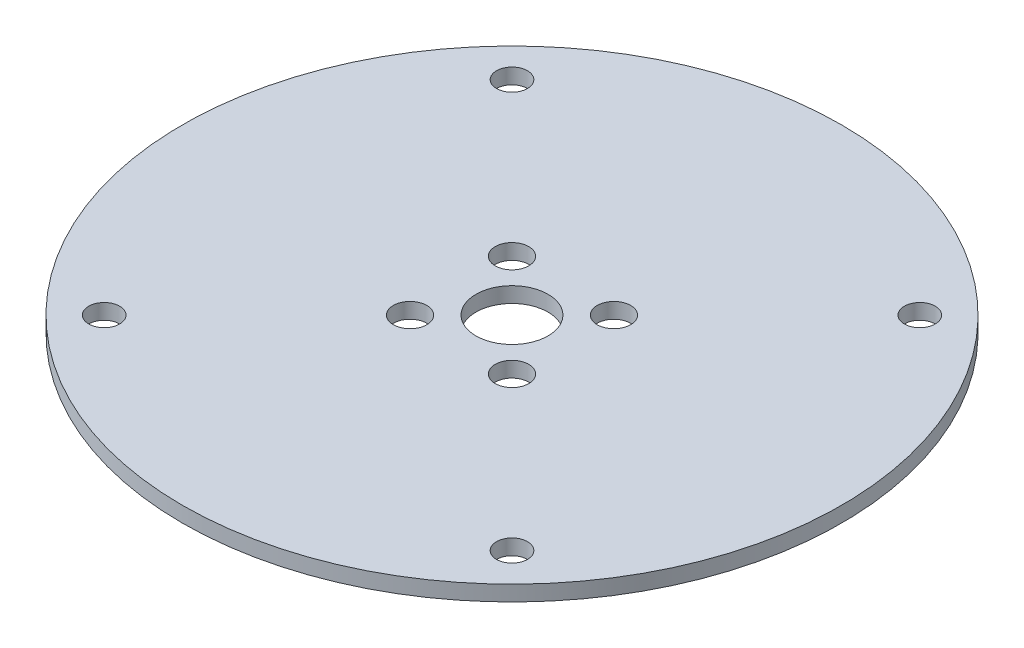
ISO-10303-21;
HEADER;
FILE_DESCRIPTION(('STEP AP214'),'2;1');
FILE_NAME('part.step','',(''),(''),'','','');
FILE_SCHEMA(('AUTOMOTIVE_DESIGN { 1 0 10303 214 1 1 1 1 }'));
ENDSEC;
DATA;
#1=APPLICATION_CONTEXT('core data for automotive mechanical design processes');
#2=APPLICATION_PROTOCOL_DEFINITION('international standard','automotive_design',2000,#1);
#3=PRODUCT_CONTEXT('',#1,'mechanical');
#4=PRODUCT('Part','Part','',(#3));
#5=PRODUCT_RELATED_PRODUCT_CATEGORY('part','',(#4));
#6=PRODUCT_DEFINITION_FORMATION('','',#4);
#7=PRODUCT_DEFINITION_CONTEXT('part definition',#1,'design');
#8=PRODUCT_DEFINITION('design','',#6,#7);
#9=PRODUCT_DEFINITION_SHAPE('','',#8);
#10=(LENGTH_UNIT() NAMED_UNIT(*) SI_UNIT(.MILLI.,.METRE.));
#11=(NAMED_UNIT(*) PLANE_ANGLE_UNIT() SI_UNIT($,.RADIAN.));
#12=(NAMED_UNIT(*) SI_UNIT($,.STERADIAN.) SOLID_ANGLE_UNIT());
#13=UNCERTAINTY_MEASURE_WITH_UNIT(LENGTH_MEASURE(1.E-05),#10,'distance_accuracy_value','');
#14=(GEOMETRIC_REPRESENTATION_CONTEXT(3) GLOBAL_UNCERTAINTY_ASSIGNED_CONTEXT((#13)) GLOBAL_UNIT_ASSIGNED_CONTEXT((#10,
#11,#12)) REPRESENTATION_CONTEXT('',''));
#15=CARTESIAN_POINT('',(0.,0.,0.));
#16=DIRECTION('',(0.,0.,1.));
#17=DIRECTION('',(1.,0.,0.));
#18=AXIS2_PLACEMENT_3D('',#15,#16,#17);
#19=CARTESIAN_POINT('',(0.,-1.5,0.));
#20=DIRECTION('',(0.,1.,0.));
#21=DIRECTION('',(0.,0.,1.));
#22=AXIS2_PLACEMENT_3D('',#19,#20,#21);
#23=CYLINDRICAL_SURFACE('',#22,32.);
#24=CARTESIAN_POINT('',(0.,-1.5,0.));
#25=DIRECTION('',(0.,1.,0.));
#26=DIRECTION('',(0.,0.,1.));
#27=AXIS2_PLACEMENT_3D('',#24,#25,#26);
#28=CIRCLE('',#27,32.);
#29=CARTESIAN_POINT('',(0.,-1.5,32.));
#30=VERTEX_POINT('',#29);
#31=EDGE_CURVE('E10',#30,#30,#28,.T.);
#32=ORIENTED_EDGE('',*,*,#31,.T.);
#33=EDGE_LOOP('',(#32));
#34=FACE_BOUND('',#33,.T.);
#35=CARTESIAN_POINT('',(0.,0.,0.));
#36=DIRECTION('',(0.,1.,0.));
#37=DIRECTION('',(0.,0.,1.));
#38=AXIS2_PLACEMENT_3D('',#35,#36,#37);
#39=CIRCLE('',#38,32.);
#40=CARTESIAN_POINT('',(0.,0.,32.));
#41=VERTEX_POINT('',#40);
#42=EDGE_CURVE('E45',#41,#41,#39,.T.);
#43=ORIENTED_EDGE('',*,*,#42,.F.);
#44=EDGE_LOOP('',(#43));
#45=FACE_BOUND('',#44,.T.);
#46=ADVANCED_FACE('F42',(#34,#45),#23,.T.);
#47=CARTESIAN_POINT('',(0.,-1.5,0.));
#48=DIRECTION('',(0.,1.,0.));
#49=DIRECTION('',(0.,0.,1.));
#50=AXIS2_PLACEMENT_3D('',#47,#48,#49);
#51=PLANE('',#50);
#52=CARTESIAN_POINT('',(-4.94974746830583,-1.5,4.94974746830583));
#53=DIRECTION('',(0.,1.,0.));
#54=DIRECTION('',(0.,0.,1.));
#55=AXIS2_PLACEMENT_3D('',#52,#53,#54);
#56=CIRCLE('',#55,1.625);
#57=CARTESIAN_POINT('',(-4.94974746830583,-1.5,6.57474746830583));
#58=VERTEX_POINT('',#57);
#59=EDGE_CURVE('E84',#58,#58,#56,.T.);
#60=ORIENTED_EDGE('',*,*,#59,.T.);
#61=EDGE_LOOP('',(#60));
#62=FACE_BOUND('',#61,.T.);
#63=CARTESIAN_POINT('',(4.94974746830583,-1.5,4.94974746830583));
#64=DIRECTION('',(0.,1.,0.));
#65=DIRECTION('',(0.,0.,1.));
#66=AXIS2_PLACEMENT_3D('',#63,#64,#65);
#67=CIRCLE('',#66,1.625);
#68=CARTESIAN_POINT('',(4.94974746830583,-1.5,6.57474746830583));
#69=VERTEX_POINT('',#68);
#70=EDGE_CURVE('E90',#69,#69,#67,.T.);
#71=ORIENTED_EDGE('',*,*,#70,.T.);
#72=EDGE_LOOP('',(#71));
#73=FACE_BOUND('',#72,.T.);
#74=CARTESIAN_POINT('',(4.94974746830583,-1.5,-4.94974746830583));
#75=DIRECTION('',(0.,1.,0.));
#76=DIRECTION('',(0.,0.,1.));
#77=AXIS2_PLACEMENT_3D('',#74,#75,#76);
#78=CIRCLE('',#77,1.625);
#79=CARTESIAN_POINT('',(4.94974746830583,-1.5,-3.32474746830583));
#80=VERTEX_POINT('',#79);
#81=EDGE_CURVE('E96',#80,#80,#78,.T.);
#82=ORIENTED_EDGE('',*,*,#81,.T.);
#83=EDGE_LOOP('',(#82));
#84=FACE_BOUND('',#83,.T.);
#85=CARTESIAN_POINT('',(-4.94974746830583,-1.5,-4.94974746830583));
#86=DIRECTION('',(0.,1.,0.));
#87=DIRECTION('',(0.,0.,1.));
#88=AXIS2_PLACEMENT_3D('',#85,#86,#87);
#89=CIRCLE('',#88,1.625);
#90=CARTESIAN_POINT('',(-4.94974746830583,-1.5,-3.32474746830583));
#91=VERTEX_POINT('',#90);
#92=EDGE_CURVE('E102',#91,#91,#89,.T.);
#93=ORIENTED_EDGE('',*,*,#92,.T.);
#94=EDGE_LOOP('',(#93));
#95=FACE_BOUND('',#94,.T.);
#96=CARTESIAN_POINT('',(0.,-1.5,0.));
#97=DIRECTION('',(0.,1.,0.));
#98=DIRECTION('',(0.,0.,1.));
#99=AXIS2_PLACEMENT_3D('',#96,#97,#98);
#100=CIRCLE('',#99,3.5);
#101=CARTESIAN_POINT('',(0.,-1.5,3.5));
#102=VERTEX_POINT('',#101);
#103=EDGE_CURVE('E64',#102,#102,#100,.T.);
#104=ORIENTED_EDGE('',*,*,#103,.T.);
#105=EDGE_LOOP('',(#104));
#106=FACE_BOUND('',#105,.T.);
#107=CARTESIAN_POINT('',(-19.7989898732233,-1.5,19.7989898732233));
#108=DIRECTION('',(0.,1.,0.));
#109=DIRECTION('',(0.,0.,1.));
#110=AXIS2_PLACEMENT_3D('',#107,#108,#109);
#111=CIRCLE('',#110,1.5);
#112=CARTESIAN_POINT('',(-19.7989898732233,-1.5,21.2989898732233));
#113=VERTEX_POINT('',#112);
#114=EDGE_CURVE('E60',#113,#113,#111,.T.);
#115=ORIENTED_EDGE('',*,*,#114,.T.);
#116=EDGE_LOOP('',(#115));
#117=FACE_BOUND('',#116,.T.);
#118=CARTESIAN_POINT('',(19.7989898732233,-1.5,19.7989898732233));
#119=DIRECTION('',(0.,1.,0.));
#120=DIRECTION('',(0.,0.,1.));
#121=AXIS2_PLACEMENT_3D('',#118,#119,#120);
#122=CIRCLE('',#121,1.5);
#123=CARTESIAN_POINT('',(19.7989898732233,-1.5,21.2989898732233));
#124=VERTEX_POINT('',#123);
#125=EDGE_CURVE('E67',#124,#124,#122,.T.);
#126=ORIENTED_EDGE('',*,*,#125,.T.);
#127=EDGE_LOOP('',(#126));
#128=FACE_BOUND('',#127,.T.);
#129=CARTESIAN_POINT('',(19.7989898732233,-1.5,-19.7989898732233));
#130=DIRECTION('',(0.,1.,0.));
#131=DIRECTION('',(0.,0.,1.));
#132=AXIS2_PLACEMENT_3D('',#129,#130,#131);
#133=CIRCLE('',#132,1.5);
#134=CARTESIAN_POINT('',(19.7989898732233,-1.5,-18.2989898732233));
#135=VERTEX_POINT('',#134);
#136=EDGE_CURVE('E73',#135,#135,#133,.T.);
#137=ORIENTED_EDGE('',*,*,#136,.T.);
#138=EDGE_LOOP('',(#137));
#139=FACE_BOUND('',#138,.T.);
#140=CARTESIAN_POINT('',(-19.7989898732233,-1.5,-19.7989898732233));
#141=DIRECTION('',(0.,1.,0.));
#142=DIRECTION('',(0.,0.,1.));
#143=AXIS2_PLACEMENT_3D('',#140,#141,#142);
#144=CIRCLE('',#143,1.5);
#145=CARTESIAN_POINT('',(-19.7989898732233,-1.5,-18.2989898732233));
#146=VERTEX_POINT('',#145);
#147=EDGE_CURVE('E52',#146,#146,#144,.T.);
#148=ORIENTED_EDGE('',*,*,#147,.T.);
#149=EDGE_LOOP('',(#148));
#150=FACE_BOUND('',#149,.T.);
#151=ORIENTED_EDGE('',*,*,#31,.F.);
#152=EDGE_LOOP('',(#151));
#153=FACE_BOUND('',#152,.T.);
#154=ADVANCED_FACE('F114',(#62,#73,#84,#95,#106,#117,#128,#139,#150,#153),#51,.F.);
#155=CARTESIAN_POINT('',(0.,0.,0.));
#156=DIRECTION('',(0.,1.,0.));
#157=DIRECTION('',(0.,0.,1.));
#158=AXIS2_PLACEMENT_3D('',#155,#156,#157);
#159=PLANE('',#158);
#160=CARTESIAN_POINT('',(-4.94974746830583,0.,4.94974746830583));
#161=DIRECTION('',(0.,1.,0.));
#162=DIRECTION('',(0.,0.,1.));
#163=AXIS2_PLACEMENT_3D('',#160,#161,#162);
#164=CIRCLE('',#163,1.625);
#165=CARTESIAN_POINT('',(-4.94974746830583,0.,6.57474746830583));
#166=VERTEX_POINT('',#165);
#167=EDGE_CURVE('E87',#166,#166,#164,.T.);
#168=ORIENTED_EDGE('',*,*,#167,.F.);
#169=EDGE_LOOP('',(#168));
#170=FACE_BOUND('',#169,.T.);
#171=CARTESIAN_POINT('',(4.94974746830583,0.,4.94974746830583));
#172=DIRECTION('',(0.,1.,0.));
#173=DIRECTION('',(0.,0.,1.));
#174=AXIS2_PLACEMENT_3D('',#171,#172,#173);
#175=CIRCLE('',#174,1.625);
#176=CARTESIAN_POINT('',(4.94974746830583,0.,6.57474746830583));
#177=VERTEX_POINT('',#176);
#178=EDGE_CURVE('E93',#177,#177,#175,.T.);
#179=ORIENTED_EDGE('',*,*,#178,.F.);
#180=EDGE_LOOP('',(#179));
#181=FACE_BOUND('',#180,.T.);
#182=CARTESIAN_POINT('',(4.94974746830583,0.,-4.94974746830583));
#183=DIRECTION('',(0.,1.,0.));
#184=DIRECTION('',(0.,0.,1.));
#185=AXIS2_PLACEMENT_3D('',#182,#183,#184);
#186=CIRCLE('',#185,1.625);
#187=CARTESIAN_POINT('',(4.94974746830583,0.,-3.32474746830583));
#188=VERTEX_POINT('',#187);
#189=EDGE_CURVE('E99',#188,#188,#186,.T.);
#190=ORIENTED_EDGE('',*,*,#189,.F.);
#191=EDGE_LOOP('',(#190));
#192=FACE_BOUND('',#191,.T.);
#193=CARTESIAN_POINT('',(-4.94974746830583,0.,-4.94974746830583));
#194=DIRECTION('',(0.,1.,0.));
#195=DIRECTION('',(0.,0.,1.));
#196=AXIS2_PLACEMENT_3D('',#193,#194,#195);
#197=CIRCLE('',#196,1.625);
#198=CARTESIAN_POINT('',(-4.94974746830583,0.,-3.32474746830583));
#199=VERTEX_POINT('',#198);
#200=EDGE_CURVE('E81',#199,#199,#197,.T.);
#201=ORIENTED_EDGE('',*,*,#200,.F.);
#202=EDGE_LOOP('',(#201));
#203=FACE_BOUND('',#202,.T.);
#204=CARTESIAN_POINT('',(0.,0.,0.));
#205=DIRECTION('',(0.,1.,0.));
#206=DIRECTION('',(0.,0.,1.));
#207=AXIS2_PLACEMENT_3D('',#204,#205,#206);
#208=CIRCLE('',#207,3.5);
#209=CARTESIAN_POINT('',(0.,0.,3.5));
#210=VERTEX_POINT('',#209);
#211=EDGE_CURVE('E78',#210,#210,#208,.T.);
#212=ORIENTED_EDGE('',*,*,#211,.F.);
#213=EDGE_LOOP('',(#212));
#214=FACE_BOUND('',#213,.T.);
#215=CARTESIAN_POINT('',(-19.7989898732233,0.,19.7989898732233));
#216=DIRECTION('',(0.,1.,0.));
#217=DIRECTION('',(0.,0.,1.));
#218=AXIS2_PLACEMENT_3D('',#215,#216,#217);
#219=CIRCLE('',#218,1.5);
#220=CARTESIAN_POINT('',(-19.7989898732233,0.,21.2989898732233));
#221=VERTEX_POINT('',#220);
#222=EDGE_CURVE('E63',#221,#221,#219,.T.);
#223=ORIENTED_EDGE('',*,*,#222,.F.);
#224=EDGE_LOOP('',(#223));
#225=FACE_BOUND('',#224,.T.);
#226=CARTESIAN_POINT('',(19.7989898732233,0.,19.7989898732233));
#227=DIRECTION('',(0.,1.,0.));
#228=DIRECTION('',(0.,0.,1.));
#229=AXIS2_PLACEMENT_3D('',#226,#227,#228);
#230=CIRCLE('',#229,1.5);
#231=CARTESIAN_POINT('',(19.7989898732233,0.,21.2989898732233));
#232=VERTEX_POINT('',#231);
#233=EDGE_CURVE('E70',#232,#232,#230,.T.);
#234=ORIENTED_EDGE('',*,*,#233,.F.);
#235=EDGE_LOOP('',(#234));
#236=FACE_BOUND('',#235,.T.);
#237=CARTESIAN_POINT('',(19.7989898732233,0.,-19.7989898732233));
#238=DIRECTION('',(0.,1.,0.));
#239=DIRECTION('',(0.,0.,1.));
#240=AXIS2_PLACEMENT_3D('',#237,#238,#239);
#241=CIRCLE('',#240,1.5);
#242=CARTESIAN_POINT('',(19.7989898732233,0.,-18.2989898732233));
#243=VERTEX_POINT('',#242);
#244=EDGE_CURVE('E57',#243,#243,#241,.T.);
#245=ORIENTED_EDGE('',*,*,#244,.F.);
#246=EDGE_LOOP('',(#245));
#247=FACE_BOUND('',#246,.T.);
#248=CARTESIAN_POINT('',(-19.7989898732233,0.,-19.7989898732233));
#249=DIRECTION('',(0.,1.,0.));
#250=DIRECTION('',(0.,0.,1.));
#251=AXIS2_PLACEMENT_3D('',#248,#249,#250);
#252=CIRCLE('',#251,1.5);
#253=CARTESIAN_POINT('',(-19.7989898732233,0.,-18.2989898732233));
#254=VERTEX_POINT('',#253);
#255=EDGE_CURVE('E54',#254,#254,#252,.T.);
#256=ORIENTED_EDGE('',*,*,#255,.F.);
#257=EDGE_LOOP('',(#256));
#258=FACE_BOUND('',#257,.T.);
#259=ORIENTED_EDGE('',*,*,#42,.T.);
#260=EDGE_LOOP('',(#259));
#261=FACE_BOUND('',#260,.T.);
#262=ADVANCED_FACE('F110',(#170,#181,#192,#203,#214,#225,#236,#247,#258,#261),#159,.T.);
#263=CARTESIAN_POINT('',(-19.7989898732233,-1.5,-19.7989898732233));
#264=DIRECTION('',(0.,1.,0.));
#265=DIRECTION('',(0.,0.,1.));
#266=AXIS2_PLACEMENT_3D('',#263,#264,#265);
#267=CYLINDRICAL_SURFACE('',#266,1.5);
#268=ORIENTED_EDGE('',*,*,#147,.F.);
#269=EDGE_LOOP('',(#268));
#270=FACE_BOUND('',#269,.T.);
#271=ORIENTED_EDGE('',*,*,#255,.T.);
#272=EDGE_LOOP('',(#271));
#273=FACE_BOUND('',#272,.T.);
#274=ADVANCED_FACE('F113',(#270,#273),#267,.F.);
#275=CARTESIAN_POINT('',(19.7989898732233,-1.5,-19.7989898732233));
#276=DIRECTION('',(0.,1.,0.));
#277=DIRECTION('',(0.,0.,1.));
#278=AXIS2_PLACEMENT_3D('',#275,#276,#277);
#279=CYLINDRICAL_SURFACE('',#278,1.5);
#280=ORIENTED_EDGE('',*,*,#136,.F.);
#281=EDGE_LOOP('',(#280));
#282=FACE_BOUND('',#281,.T.);
#283=ORIENTED_EDGE('',*,*,#244,.T.);
#284=EDGE_LOOP('',(#283));
#285=FACE_BOUND('',#284,.T.);
#286=ADVANCED_FACE('F141',(#282,#285),#279,.F.);
#287=CARTESIAN_POINT('',(19.7989898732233,-1.5,19.7989898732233));
#288=DIRECTION('',(0.,1.,0.));
#289=DIRECTION('',(0.,0.,1.));
#290=AXIS2_PLACEMENT_3D('',#287,#288,#289);
#291=CYLINDRICAL_SURFACE('',#290,1.5);
#292=ORIENTED_EDGE('',*,*,#125,.F.);
#293=EDGE_LOOP('',(#292));
#294=FACE_BOUND('',#293,.T.);
#295=ORIENTED_EDGE('',*,*,#233,.T.);
#296=EDGE_LOOP('',(#295));
#297=FACE_BOUND('',#296,.T.);
#298=ADVANCED_FACE('F147',(#294,#297),#291,.F.);
#299=CARTESIAN_POINT('',(-19.7989898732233,-1.5,19.7989898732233));
#300=DIRECTION('',(0.,1.,0.));
#301=DIRECTION('',(0.,0.,1.));
#302=AXIS2_PLACEMENT_3D('',#299,#300,#301);
#303=CYLINDRICAL_SURFACE('',#302,1.5);
#304=ORIENTED_EDGE('',*,*,#114,.F.);
#305=EDGE_LOOP('',(#304));
#306=FACE_BOUND('',#305,.T.);
#307=ORIENTED_EDGE('',*,*,#222,.T.);
#308=EDGE_LOOP('',(#307));
#309=FACE_BOUND('',#308,.T.);
#310=ADVANCED_FACE('F143',(#306,#309),#303,.F.);
#311=CARTESIAN_POINT('',(0.,-1.5,0.));
#312=DIRECTION('',(0.,1.,0.));
#313=DIRECTION('',(0.,0.,1.));
#314=AXIS2_PLACEMENT_3D('',#311,#312,#313);
#315=CYLINDRICAL_SURFACE('',#314,3.5);
#316=ORIENTED_EDGE('',*,*,#103,.F.);
#317=EDGE_LOOP('',(#316));
#318=FACE_BOUND('',#317,.T.);
#319=ORIENTED_EDGE('',*,*,#211,.T.);
#320=EDGE_LOOP('',(#319));
#321=FACE_BOUND('',#320,.T.);
#322=ADVANCED_FACE('F146',(#318,#321),#315,.F.);
#323=CARTESIAN_POINT('',(-4.94974746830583,-1.5,-4.94974746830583));
#324=DIRECTION('',(0.,1.,0.));
#325=DIRECTION('',(0.,0.,1.));
#326=AXIS2_PLACEMENT_3D('',#323,#324,#325);
#327=CYLINDRICAL_SURFACE('',#326,1.625);
#328=ORIENTED_EDGE('',*,*,#92,.F.);
#329=EDGE_LOOP('',(#328));
#330=FACE_BOUND('',#329,.T.);
#331=ORIENTED_EDGE('',*,*,#200,.T.);
#332=EDGE_LOOP('',(#331));
#333=FACE_BOUND('',#332,.T.);
#334=ADVANCED_FACE('F108',(#330,#333),#327,.F.);
#335=CARTESIAN_POINT('',(4.94974746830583,-1.5,-4.94974746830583));
#336=DIRECTION('',(0.,1.,0.));
#337=DIRECTION('',(0.,0.,1.));
#338=AXIS2_PLACEMENT_3D('',#335,#336,#337);
#339=CYLINDRICAL_SURFACE('',#338,1.625);
#340=ORIENTED_EDGE('',*,*,#81,.F.);
#341=EDGE_LOOP('',(#340));
#342=FACE_BOUND('',#341,.T.);
#343=ORIENTED_EDGE('',*,*,#189,.T.);
#344=EDGE_LOOP('',(#343));
#345=FACE_BOUND('',#344,.T.);
#346=ADVANCED_FACE('F165',(#342,#345),#339,.F.);
#347=CARTESIAN_POINT('',(4.94974746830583,-1.5,4.94974746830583));
#348=DIRECTION('',(0.,1.,0.));
#349=DIRECTION('',(0.,0.,1.));
#350=AXIS2_PLACEMENT_3D('',#347,#348,#349);
#351=CYLINDRICAL_SURFACE('',#350,1.625);
#352=ORIENTED_EDGE('',*,*,#70,.F.);
#353=EDGE_LOOP('',(#352));
#354=FACE_BOUND('',#353,.T.);
#355=ORIENTED_EDGE('',*,*,#178,.T.);
#356=EDGE_LOOP('',(#355));
#357=FACE_BOUND('',#356,.T.);
#358=ADVANCED_FACE('F161',(#354,#357),#351,.F.);
#359=CARTESIAN_POINT('',(-4.94974746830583,-1.5,4.94974746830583));
#360=DIRECTION('',(0.,1.,0.));
#361=DIRECTION('',(0.,0.,1.));
#362=AXIS2_PLACEMENT_3D('',#359,#360,#361);
#363=CYLINDRICAL_SURFACE('',#362,1.625);
#364=ORIENTED_EDGE('',*,*,#59,.F.);
#365=EDGE_LOOP('',(#364));
#366=FACE_BOUND('',#365,.T.);
#367=ORIENTED_EDGE('',*,*,#167,.T.);
#368=EDGE_LOOP('',(#367));
#369=FACE_BOUND('',#368,.T.);
#370=ADVANCED_FACE('F158',(#366,#369),#363,.F.);
#371=CLOSED_SHELL('',(#46,#154,#262,#274,#286,#298,#310,#322,#334,#346,#358,#370));
#372=MANIFOLD_SOLID_BREP('B2',#371);
#373=ADVANCED_BREP_SHAPE_REPRESENTATION('',(#18,#372),#14);
#374=SHAPE_DEFINITION_REPRESENTATION(#9,#373);
ENDSEC;
END-ISO-10303-21;
